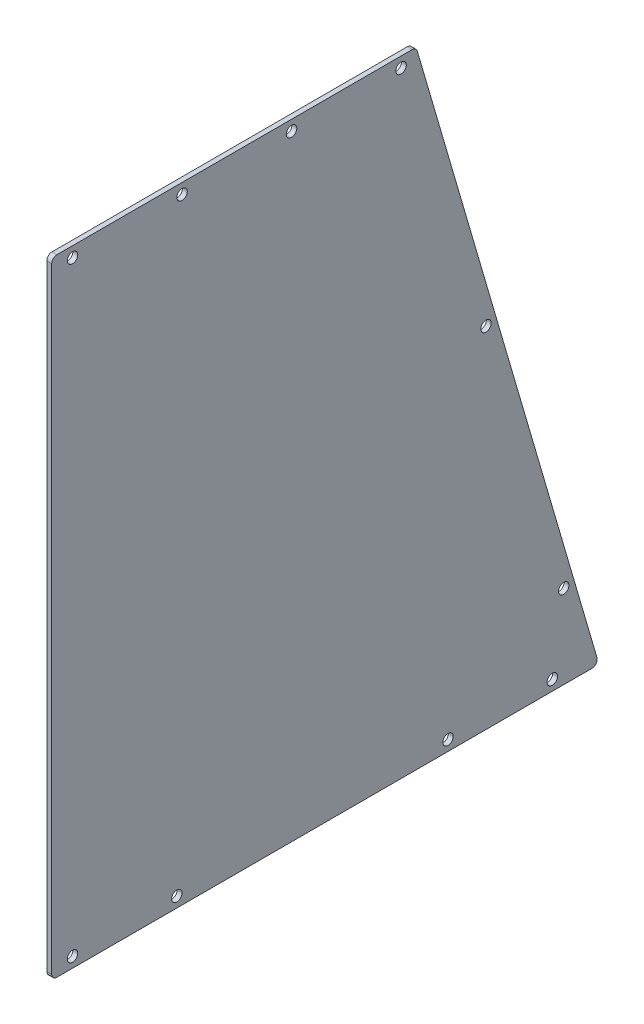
ISO-10303-21;
HEADER;
FILE_DESCRIPTION(('STEP AP214'),'2;1');
FILE_NAME('part.step','',(''),(''),'','','');
FILE_SCHEMA(('AUTOMOTIVE_DESIGN { 1 0 10303 214 1 1 1 1 }'));
ENDSEC;
DATA;
#1=APPLICATION_CONTEXT('core data for automotive mechanical design processes');
#2=APPLICATION_PROTOCOL_DEFINITION('international standard','automotive_design',2000,#1);
#3=PRODUCT_CONTEXT('',#1,'mechanical');
#4=PRODUCT('Part','Part','',(#3));
#5=PRODUCT_RELATED_PRODUCT_CATEGORY('part','',(#4));
#6=PRODUCT_DEFINITION_FORMATION('','',#4);
#7=PRODUCT_DEFINITION_CONTEXT('part definition',#1,'design');
#8=PRODUCT_DEFINITION('design','',#6,#7);
#9=PRODUCT_DEFINITION_SHAPE('','',#8);
#10=(LENGTH_UNIT() NAMED_UNIT(*) SI_UNIT(.MILLI.,.METRE.));
#11=(NAMED_UNIT(*) PLANE_ANGLE_UNIT() SI_UNIT($,.RADIAN.));
#12=(NAMED_UNIT(*) SI_UNIT($,.STERADIAN.) SOLID_ANGLE_UNIT());
#13=UNCERTAINTY_MEASURE_WITH_UNIT(LENGTH_MEASURE(1.E-05),#10,'distance_accuracy_value','');
#14=(GEOMETRIC_REPRESENTATION_CONTEXT(3) GLOBAL_UNCERTAINTY_ASSIGNED_CONTEXT((#13)) GLOBAL_UNIT_ASSIGNED_CONTEXT((#10,
#11,#12)) REPRESENTATION_CONTEXT('',''));
#15=CARTESIAN_POINT('',(0.,0.,0.));
#16=DIRECTION('',(0.,0.,1.));
#17=DIRECTION('',(1.,0.,0.));
#18=AXIS2_PLACEMENT_3D('',#15,#16,#17);
#19=CARTESIAN_POINT('',(226.8347,-67.6339615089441,488.450730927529));
#20=DIRECTION('',(-1.,0.,0.));
#21=DIRECTION('',(0.,0.,1.));
#22=AXIS2_PLACEMENT_3D('',#19,#20,#21);
#23=CYLINDRICAL_SURFACE('',#22,3.175);
#24=CARTESIAN_POINT('',(226.8347,-67.6339615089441,488.450730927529));
#25=DIRECTION('',(1.,0.,0.));
#26=DIRECTION('',(0.,0.,-1.));
#27=AXIS2_PLACEMENT_3D('',#24,#25,#26);
#28=CIRCLE('',#27,3.175);
#29=CARTESIAN_POINT('',(226.8347,-67.6339615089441,491.625730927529));
#30=VERTEX_POINT('',#29);
#31=CARTESIAN_POINT('',(226.8347,-70.8089615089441,488.450730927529));
#32=VERTEX_POINT('',#31);
#33=EDGE_CURVE('E266',#30,#32,#28,.T.);
#34=ORIENTED_EDGE('',*,*,#33,.F.);
#35=DIRECTION('',(1.,0.,0.));
#36=VECTOR('',#35,1.);
#37=CARTESIAN_POINT('',(226.8347,-67.6339615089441,491.625730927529));
#38=LINE('',#37,#36);
#39=CARTESIAN_POINT('',(223.8375,-67.6339615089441,491.625730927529));
#40=VERTEX_POINT('',#39);
#41=EDGE_CURVE('E226',#40,#30,#38,.T.);
#42=ORIENTED_EDGE('',*,*,#41,.F.);
#43=CARTESIAN_POINT('',(223.8375,-67.6339615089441,488.450730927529));
#44=DIRECTION('',(-1.,0.,0.));
#45=DIRECTION('',(0.,0.,-1.));
#46=AXIS2_PLACEMENT_3D('',#43,#44,#45);
#47=CIRCLE('',#46,3.175);
#48=CARTESIAN_POINT('',(223.8375,-70.8089615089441,488.450730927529));
#49=VERTEX_POINT('',#48);
#50=EDGE_CURVE('E11',#49,#40,#47,.T.);
#51=ORIENTED_EDGE('',*,*,#50,.F.);
#52=DIRECTION('',(-1.,0.,0.));
#53=VECTOR('',#52,1.);
#54=CARTESIAN_POINT('',(226.8347,-70.8089615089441,488.450730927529));
#55=LINE('',#54,#53);
#56=EDGE_CURVE('E247',#32,#49,#55,.T.);
#57=ORIENTED_EDGE('',*,*,#56,.F.);
#58=EDGE_LOOP('',(#34,#42,#51,#57));
#59=FACE_BOUND('',#58,.T.);
#60=ADVANCED_FACE('F17',(#59),#23,.T.);
#61=CARTESIAN_POINT('',(226.8347,-67.633961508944,162.648427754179));
#62=DIRECTION('',(-1.,0.,0.));
#63=DIRECTION('',(0.,0.,1.));
#64=AXIS2_PLACEMENT_3D('',#61,#62,#63);
#65=CYLINDRICAL_SURFACE('',#64,3.175);
#66=CARTESIAN_POINT('',(226.8347,-67.633961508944,162.648427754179));
#67=DIRECTION('',(1.,0.,0.));
#68=DIRECTION('',(0.,0.,-1.));
#69=AXIS2_PLACEMENT_3D('',#66,#67,#68);
#70=CIRCLE('',#69,3.175);
#71=CARTESIAN_POINT('',(226.8347,-70.808961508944,162.648427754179));
#72=VERTEX_POINT('',#71);
#73=CARTESIAN_POINT('',(226.8347,-66.7435693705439,159.600834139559));
#74=VERTEX_POINT('',#73);
#75=EDGE_CURVE('E262',#72,#74,#70,.T.);
#76=ORIENTED_EDGE('',*,*,#75,.F.);
#77=DIRECTION('',(1.,0.,0.));
#78=VECTOR('',#77,1.);
#79=CARTESIAN_POINT('',(226.8347,-70.808961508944,162.648427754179));
#80=LINE('',#79,#78);
#81=CARTESIAN_POINT('',(223.8375,-70.808961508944,162.648427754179));
#82=VERTEX_POINT('',#81);
#83=EDGE_CURVE('E238',#82,#72,#80,.T.);
#84=ORIENTED_EDGE('',*,*,#83,.F.);
#85=CARTESIAN_POINT('',(223.8375,-67.633961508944,162.648427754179));
#86=DIRECTION('',(-1.,0.,0.));
#87=DIRECTION('',(0.,0.,-1.));
#88=AXIS2_PLACEMENT_3D('',#85,#86,#87);
#89=CIRCLE('',#88,3.175);
#90=CARTESIAN_POINT('',(223.8375,-66.7435693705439,159.600834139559));
#91=VERTEX_POINT('',#90);
#92=EDGE_CURVE('E20',#91,#82,#89,.T.);
#93=ORIENTED_EDGE('',*,*,#92,.F.);
#94=DIRECTION('',(-1.,0.,0.));
#95=VECTOR('',#94,1.);
#96=CARTESIAN_POINT('',(226.8347,-66.7435693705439,159.600834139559));
#97=LINE('',#96,#95);
#98=EDGE_CURVE('E212',#74,#91,#97,.T.);
#99=ORIENTED_EDGE('',*,*,#98,.F.);
#100=EDGE_LOOP('',(#76,#84,#93,#99));
#101=FACE_BOUND('',#100,.T.);
#102=ADVANCED_FACE('F359',(#101),#65,.T.);
#103=CARTESIAN_POINT('',(226.8347,307.016038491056,272.107055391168));
#104=DIRECTION('',(-1.,0.,0.));
#105=DIRECTION('',(0.,0.,1.));
#106=AXIS2_PLACEMENT_3D('',#103,#104,#105);
#107=CYLINDRICAL_SURFACE('',#106,3.175);
#108=CARTESIAN_POINT('',(226.8347,307.016038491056,272.107055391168));
#109=DIRECTION('',(1.,0.,0.));
#110=DIRECTION('',(0.,0.,-1.));
#111=AXIS2_PLACEMENT_3D('',#108,#109,#110);
#112=CIRCLE('',#111,3.175);
#113=CARTESIAN_POINT('',(226.8347,307.906430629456,269.059461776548));
#114=VERTEX_POINT('',#113);
#115=CARTESIAN_POINT('',(226.8347,310.191038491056,272.107055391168));
#116=VERTEX_POINT('',#115);
#117=EDGE_CURVE('E265',#114,#116,#112,.T.);
#118=ORIENTED_EDGE('',*,*,#117,.F.);
#119=DIRECTION('',(1.,0.,0.));
#120=VECTOR('',#119,1.);
#121=CARTESIAN_POINT('',(226.8347,307.906430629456,269.059461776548));
#122=LINE('',#121,#120);
#123=CARTESIAN_POINT('',(223.8375,307.906430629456,269.059461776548));
#124=VERTEX_POINT('',#123);
#125=EDGE_CURVE('E188',#124,#114,#122,.T.);
#126=ORIENTED_EDGE('',*,*,#125,.F.);
#127=CARTESIAN_POINT('',(223.8375,307.016038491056,272.107055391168));
#128=DIRECTION('',(-1.,0.,0.));
#129=DIRECTION('',(0.,0.,-1.));
#130=AXIS2_PLACEMENT_3D('',#127,#128,#129);
#131=CIRCLE('',#130,3.175);
#132=CARTESIAN_POINT('',(223.8375,310.191038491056,272.107055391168));
#133=VERTEX_POINT('',#132);
#134=EDGE_CURVE('E182',#133,#124,#131,.T.);
#135=ORIENTED_EDGE('',*,*,#134,.F.);
#136=DIRECTION('',(-1.,0.,0.));
#137=VECTOR('',#136,1.);
#138=CARTESIAN_POINT('',(226.8347,310.191038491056,272.107055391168));
#139=LINE('',#138,#137);
#140=EDGE_CURVE('E185',#116,#133,#139,.T.);
#141=ORIENTED_EDGE('',*,*,#140,.F.);
#142=EDGE_LOOP('',(#118,#126,#135,#141));
#143=FACE_BOUND('',#142,.T.);
#144=ADVANCED_FACE('F184',(#143),#107,.T.);
#145=CARTESIAN_POINT('',(226.8347,307.016038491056,488.450730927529));
#146=DIRECTION('',(-1.,0.,0.));
#147=DIRECTION('',(0.,0.,1.));
#148=AXIS2_PLACEMENT_3D('',#145,#146,#147);
#149=CYLINDRICAL_SURFACE('',#148,3.175);
#150=CARTESIAN_POINT('',(226.8347,307.016038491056,488.450730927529));
#151=DIRECTION('',(1.,0.,0.));
#152=DIRECTION('',(0.,0.,-1.));
#153=AXIS2_PLACEMENT_3D('',#150,#151,#152);
#154=CIRCLE('',#153,3.175);
#155=CARTESIAN_POINT('',(226.8347,310.191038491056,488.450730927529));
#156=VERTEX_POINT('',#155);
#157=CARTESIAN_POINT('',(226.8347,307.016038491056,491.625730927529));
#158=VERTEX_POINT('',#157);
#159=EDGE_CURVE('E283',#156,#158,#154,.T.);
#160=ORIENTED_EDGE('',*,*,#159,.F.);
#161=DIRECTION('',(1.,0.,0.));
#162=VECTOR('',#161,1.);
#163=CARTESIAN_POINT('',(226.8347,310.191038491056,488.450730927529));
#164=LINE('',#163,#162);
#165=CARTESIAN_POINT('',(223.8375,310.191038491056,488.450730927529));
#166=VERTEX_POINT('',#165);
#167=EDGE_CURVE('E211',#166,#156,#164,.T.);
#168=ORIENTED_EDGE('',*,*,#167,.F.);
#169=CARTESIAN_POINT('',(223.8375,307.016038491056,488.450730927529));
#170=DIRECTION('',(-1.,0.,0.));
#171=DIRECTION('',(0.,0.,-1.));
#172=AXIS2_PLACEMENT_3D('',#169,#170,#171);
#173=CIRCLE('',#172,3.175);
#174=CARTESIAN_POINT('',(223.8375,307.016038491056,491.625730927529));
#175=VERTEX_POINT('',#174);
#176=EDGE_CURVE('E194',#175,#166,#173,.T.);
#177=ORIENTED_EDGE('',*,*,#176,.F.);
#178=DIRECTION('',(-1.,0.,0.));
#179=VECTOR('',#178,1.);
#180=CARTESIAN_POINT('',(226.8347,307.016038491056,491.625730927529));
#181=LINE('',#180,#179);
#182=EDGE_CURVE('E231',#158,#175,#181,.T.);
#183=ORIENTED_EDGE('',*,*,#182,.F.);
#184=EDGE_LOOP('',(#160,#168,#177,#183));
#185=FACE_BOUND('',#184,.T.);
#186=ADVANCED_FACE('F361',(#185),#149,.T.);
#187=CARTESIAN_POINT('',(228.6,141.916038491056,227.178782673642));
#188=DIRECTION('',(-1.,0.,0.));
#189=DIRECTION('',(0.,0.,1.));
#190=AXIS2_PLACEMENT_3D('',#187,#188,#189);
#191=CYLINDRICAL_SURFACE('',#190,3.175);
#192=CARTESIAN_POINT('',(223.8375,141.916038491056,227.178782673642));
#193=DIRECTION('',(-1.,0.,0.));
#194=DIRECTION('',(0.,0.,-1.));
#195=AXIS2_PLACEMENT_3D('',#192,#193,#194);
#196=CIRCLE('',#195,3.175);
#197=CARTESIAN_POINT('',(223.8375,141.916038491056,224.003782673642));
#198=VERTEX_POINT('',#197);
#199=EDGE_CURVE('E293',#198,#198,#196,.T.);
#200=ORIENTED_EDGE('',*,*,#199,.T.);
#201=EDGE_LOOP('',(#200));
#202=FACE_BOUND('',#201,.T.);
#203=CARTESIAN_POINT('',(226.8347,141.916038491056,227.178782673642));
#204=DIRECTION('',(-1.,0.,0.));
#205=DIRECTION('',(0.,0.,-1.));
#206=AXIS2_PLACEMENT_3D('',#203,#204,#205);
#207=CIRCLE('',#206,3.175);
#208=CARTESIAN_POINT('',(226.8347,141.916038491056,224.003782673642));
#209=VERTEX_POINT('',#208);
#210=EDGE_CURVE('E243',#209,#209,#207,.T.);
#211=ORIENTED_EDGE('',*,*,#210,.F.);
#212=EDGE_LOOP('',(#211));
#213=FACE_BOUND('',#212,.T.);
#214=ADVANCED_FACE('F363',(#202,#213),#191,.F.);
#215=CARTESIAN_POINT('',(228.6,-20.0089615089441,179.87039276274));
#216=DIRECTION('',(-1.,0.,0.));
#217=DIRECTION('',(0.,0.,1.));
#218=AXIS2_PLACEMENT_3D('',#215,#216,#217);
#219=CYLINDRICAL_SURFACE('',#218,3.175);
#220=CARTESIAN_POINT('',(223.8375,-20.0089615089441,179.87039276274));
#221=DIRECTION('',(-1.,0.,0.));
#222=DIRECTION('',(0.,0.,-1.));
#223=AXIS2_PLACEMENT_3D('',#220,#221,#222);
#224=CIRCLE('',#223,3.175);
#225=CARTESIAN_POINT('',(223.8375,-20.0089615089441,176.69539276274));
#226=VERTEX_POINT('',#225);
#227=EDGE_CURVE('E261',#226,#226,#224,.T.);
#228=ORIENTED_EDGE('',*,*,#227,.T.);
#229=EDGE_LOOP('',(#228));
#230=FACE_BOUND('',#229,.T.);
#231=CARTESIAN_POINT('',(226.8347,-20.0089615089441,179.87039276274));
#232=DIRECTION('',(-1.,0.,0.));
#233=DIRECTION('',(0.,0.,-1.));
#234=AXIS2_PLACEMENT_3D('',#231,#232,#233);
#235=CIRCLE('',#234,3.175);
#236=CARTESIAN_POINT('',(226.8347,-20.0089615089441,176.69539276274));
#237=VERTEX_POINT('',#236);
#238=EDGE_CURVE('E246',#237,#237,#235,.T.);
#239=ORIENTED_EDGE('',*,*,#238,.F.);
#240=EDGE_LOOP('',(#239));
#241=FACE_BOUND('',#240,.T.);
#242=ADVANCED_FACE('F371',(#230,#241),#219,.F.);
#243=CARTESIAN_POINT('',(228.6,-64.4589615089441,478.925730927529));
#244=DIRECTION('',(-1.,0.,0.));
#245=DIRECTION('',(0.,0.,1.));
#246=AXIS2_PLACEMENT_3D('',#243,#244,#245);
#247=CYLINDRICAL_SURFACE('',#246,3.175);
#248=CARTESIAN_POINT('',(223.8375,-64.4589615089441,478.925730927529));
#249=DIRECTION('',(-1.,0.,0.));
#250=DIRECTION('',(0.,0.,-1.));
#251=AXIS2_PLACEMENT_3D('',#248,#249,#250);
#252=CIRCLE('',#251,3.175);
#253=CARTESIAN_POINT('',(223.8375,-64.4589615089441,475.750730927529));
#254=VERTEX_POINT('',#253);
#255=EDGE_CURVE('E257',#254,#254,#252,.T.);
#256=ORIENTED_EDGE('',*,*,#255,.T.);
#257=EDGE_LOOP('',(#256));
#258=FACE_BOUND('',#257,.T.);
#259=CARTESIAN_POINT('',(226.8347,-64.4589615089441,478.925730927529));
#260=DIRECTION('',(-1.,0.,0.));
#261=DIRECTION('',(0.,0.,-1.));
#262=AXIS2_PLACEMENT_3D('',#259,#260,#261);
#263=CIRCLE('',#262,3.175);
#264=CARTESIAN_POINT('',(226.8347,-64.4589615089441,475.750730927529));
#265=VERTEX_POINT('',#264);
#266=EDGE_CURVE('E250',#265,#265,#263,.T.);
#267=ORIENTED_EDGE('',*,*,#266,.F.);
#268=EDGE_LOOP('',(#267));
#269=FACE_BOUND('',#268,.T.);
#270=ADVANCED_FACE('F416',(#258,#269),#247,.F.);
#271=CARTESIAN_POINT('',(228.6,-64.4589615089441,415.425730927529));
#272=DIRECTION('',(-1.,0.,0.));
#273=DIRECTION('',(0.,0.,1.));
#274=AXIS2_PLACEMENT_3D('',#271,#272,#273);
#275=CYLINDRICAL_SURFACE('',#274,3.175);
#276=CARTESIAN_POINT('',(223.8375,-64.4589615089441,415.425730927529));
#277=DIRECTION('',(-1.,0.,0.));
#278=DIRECTION('',(0.,0.,-1.));
#279=AXIS2_PLACEMENT_3D('',#276,#277,#278);
#280=CIRCLE('',#279,3.175);
#281=CARTESIAN_POINT('',(223.8375,-64.4589615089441,412.250730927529));
#282=VERTEX_POINT('',#281);
#283=EDGE_CURVE('E260',#282,#282,#280,.T.);
#284=ORIENTED_EDGE('',*,*,#283,.T.);
#285=EDGE_LOOP('',(#284));
#286=FACE_BOUND('',#285,.T.);
#287=CARTESIAN_POINT('',(226.8347,-64.4589615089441,415.425730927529));
#288=DIRECTION('',(-1.,0.,0.));
#289=DIRECTION('',(0.,0.,-1.));
#290=AXIS2_PLACEMENT_3D('',#287,#288,#289);
#291=CIRCLE('',#290,3.175);
#292=CARTESIAN_POINT('',(226.8347,-64.4589615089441,412.250730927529));
#293=VERTEX_POINT('',#292);
#294=EDGE_CURVE('E253',#293,#293,#291,.T.);
#295=ORIENTED_EDGE('',*,*,#294,.F.);
#296=EDGE_LOOP('',(#295));
#297=FACE_BOUND('',#296,.T.);
#298=ADVANCED_FACE('F425',(#286,#297),#275,.F.);
#299=CARTESIAN_POINT('',(228.6,-64.4589615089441,250.325730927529));
#300=DIRECTION('',(-1.,0.,0.));
#301=DIRECTION('',(0.,0.,1.));
#302=AXIS2_PLACEMENT_3D('',#299,#300,#301);
#303=CYLINDRICAL_SURFACE('',#302,3.175);
#304=CARTESIAN_POINT('',(223.8375,-64.4589615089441,250.325730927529));
#305=DIRECTION('',(-1.,0.,0.));
#306=DIRECTION('',(0.,0.,-1.));
#307=AXIS2_PLACEMENT_3D('',#304,#305,#306);
#308=CIRCLE('',#307,3.175);
#309=CARTESIAN_POINT('',(223.8375,-64.4589615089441,247.150730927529));
#310=VERTEX_POINT('',#309);
#311=EDGE_CURVE('E296',#310,#310,#308,.T.);
#312=ORIENTED_EDGE('',*,*,#311,.T.);
#313=EDGE_LOOP('',(#312));
#314=FACE_BOUND('',#313,.T.);
#315=CARTESIAN_POINT('',(226.8347,-64.4589615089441,250.325730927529));
#316=DIRECTION('',(-1.,0.,0.));
#317=DIRECTION('',(0.,0.,-1.));
#318=AXIS2_PLACEMENT_3D('',#315,#316,#317);
#319=CIRCLE('',#318,3.175);
#320=CARTESIAN_POINT('',(226.8347,-64.4589615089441,247.150730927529));
#321=VERTEX_POINT('',#320);
#322=EDGE_CURVE('E256',#321,#321,#319,.T.);
#323=ORIENTED_EDGE('',*,*,#322,.F.);
#324=EDGE_LOOP('',(#323));
#325=FACE_BOUND('',#324,.T.);
#326=ADVANCED_FACE('F433',(#314,#325),#303,.F.);
#327=CARTESIAN_POINT('',(228.6,-64.458961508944,186.825730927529));
#328=DIRECTION('',(-1.,0.,0.));
#329=DIRECTION('',(0.,0.,1.));
#330=AXIS2_PLACEMENT_3D('',#327,#328,#329);
#331=CYLINDRICAL_SURFACE('',#330,3.175);
#332=CARTESIAN_POINT('',(223.8375,-64.458961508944,186.825730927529));
#333=DIRECTION('',(-1.,0.,0.));
#334=DIRECTION('',(0.,0.,-1.));
#335=AXIS2_PLACEMENT_3D('',#332,#333,#334);
#336=CIRCLE('',#335,3.175);
#337=CARTESIAN_POINT('',(223.8375,-64.458961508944,183.650730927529));
#338=VERTEX_POINT('',#337);
#339=EDGE_CURVE('E299',#338,#338,#336,.T.);
#340=ORIENTED_EDGE('',*,*,#339,.T.);
#341=EDGE_LOOP('',(#340));
#342=FACE_BOUND('',#341,.T.);
#343=CARTESIAN_POINT('',(226.8347,-64.458961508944,186.825730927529));
#344=DIRECTION('',(-1.,0.,0.));
#345=DIRECTION('',(0.,0.,-1.));
#346=AXIS2_PLACEMENT_3D('',#343,#344,#345);
#347=CIRCLE('',#346,3.175);
#348=CARTESIAN_POINT('',(226.8347,-64.458961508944,183.650730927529));
#349=VERTEX_POINT('',#348);
#350=EDGE_CURVE('E268',#349,#349,#347,.T.);
#351=ORIENTED_EDGE('',*,*,#350,.F.);
#352=EDGE_LOOP('',(#351));
#353=FACE_BOUND('',#352,.T.);
#354=ADVANCED_FACE('F442',(#342,#353),#331,.F.);
#355=CARTESIAN_POINT('',(228.6,303.841038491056,278.900730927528));
#356=DIRECTION('',(-1.,0.,0.));
#357=DIRECTION('',(0.,0.,1.));
#358=AXIS2_PLACEMENT_3D('',#355,#356,#357);
#359=CYLINDRICAL_SURFACE('',#358,3.175);
#360=CARTESIAN_POINT('',(223.8375,303.841038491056,278.900730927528));
#361=DIRECTION('',(-1.,0.,0.));
#362=DIRECTION('',(0.,0.,-1.));
#363=AXIS2_PLACEMENT_3D('',#360,#361,#362);
#364=CIRCLE('',#363,3.175);
#365=CARTESIAN_POINT('',(223.8375,303.841038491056,275.725730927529));
#366=VERTEX_POINT('',#365);
#367=EDGE_CURVE('E277',#366,#366,#364,.T.);
#368=ORIENTED_EDGE('',*,*,#367,.T.);
#369=EDGE_LOOP('',(#368));
#370=FACE_BOUND('',#369,.T.);
#371=CARTESIAN_POINT('',(226.8347,303.841038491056,278.900730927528));
#372=DIRECTION('',(-1.,0.,0.));
#373=DIRECTION('',(0.,0.,-1.));
#374=AXIS2_PLACEMENT_3D('',#371,#372,#373);
#375=CIRCLE('',#374,3.175);
#376=CARTESIAN_POINT('',(226.8347,303.841038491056,275.725730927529));
#377=VERTEX_POINT('',#376);
#378=EDGE_CURVE('E270',#377,#377,#375,.T.);
#379=ORIENTED_EDGE('',*,*,#378,.F.);
#380=EDGE_LOOP('',(#379));
#381=FACE_BOUND('',#380,.T.);
#382=ADVANCED_FACE('F451',(#370,#381),#359,.F.);
#383=CARTESIAN_POINT('',(228.6,303.841038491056,345.575730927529));
#384=DIRECTION('',(-1.,0.,0.));
#385=DIRECTION('',(0.,0.,1.));
#386=AXIS2_PLACEMENT_3D('',#383,#384,#385);
#387=CYLINDRICAL_SURFACE('',#386,3.175);
#388=CARTESIAN_POINT('',(223.8375,303.841038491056,345.575730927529));
#389=DIRECTION('',(-1.,0.,0.));
#390=DIRECTION('',(0.,0.,-1.));
#391=AXIS2_PLACEMENT_3D('',#388,#389,#390);
#392=CIRCLE('',#391,3.175);
#393=CARTESIAN_POINT('',(223.8375,303.841038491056,342.400730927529));
#394=VERTEX_POINT('',#393);
#395=EDGE_CURVE('E274',#394,#394,#392,.T.);
#396=ORIENTED_EDGE('',*,*,#395,.T.);
#397=EDGE_LOOP('',(#396));
#398=FACE_BOUND('',#397,.T.);
#399=CARTESIAN_POINT('',(226.8347,303.841038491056,345.575730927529));
#400=DIRECTION('',(-1.,0.,0.));
#401=DIRECTION('',(0.,0.,-1.));
#402=AXIS2_PLACEMENT_3D('',#399,#400,#401);
#403=CIRCLE('',#402,3.175);
#404=CARTESIAN_POINT('',(226.8347,303.841038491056,342.400730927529));
#405=VERTEX_POINT('',#404);
#406=EDGE_CURVE('E273',#405,#405,#403,.T.);
#407=ORIENTED_EDGE('',*,*,#406,.F.);
#408=EDGE_LOOP('',(#407));
#409=FACE_BOUND('',#408,.T.);
#410=ADVANCED_FACE('F460',(#398,#409),#387,.F.);
#411=CARTESIAN_POINT('',(228.6,303.841038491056,478.925730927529));
#412=DIRECTION('',(-1.,0.,0.));
#413=DIRECTION('',(0.,0.,1.));
#414=AXIS2_PLACEMENT_3D('',#411,#412,#413);
#415=CYLINDRICAL_SURFACE('',#414,3.175);
#416=CARTESIAN_POINT('',(223.8375,303.841038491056,478.925730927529));
#417=DIRECTION('',(-1.,0.,0.));
#418=DIRECTION('',(0.,0.,-1.));
#419=AXIS2_PLACEMENT_3D('',#416,#417,#418);
#420=CIRCLE('',#419,3.175);
#421=CARTESIAN_POINT('',(223.8375,303.841038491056,475.750730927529));
#422=VERTEX_POINT('',#421);
#423=EDGE_CURVE('E43',#422,#422,#420,.T.);
#424=ORIENTED_EDGE('',*,*,#423,.T.);
#425=EDGE_LOOP('',(#424));
#426=FACE_BOUND('',#425,.T.);
#427=CARTESIAN_POINT('',(226.8347,303.841038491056,478.925730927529));
#428=DIRECTION('',(-1.,0.,0.));
#429=DIRECTION('',(0.,0.,-1.));
#430=AXIS2_PLACEMENT_3D('',#427,#428,#429);
#431=CIRCLE('',#430,3.175);
#432=CARTESIAN_POINT('',(226.8347,303.841038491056,475.750730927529));
#433=VERTEX_POINT('',#432);
#434=EDGE_CURVE('E280',#433,#433,#431,.T.);
#435=ORIENTED_EDGE('',*,*,#434,.F.);
#436=EDGE_LOOP('',(#435));
#437=FACE_BOUND('',#436,.T.);
#438=ADVANCED_FACE('F469',(#426,#437),#415,.F.);
#439=CARTESIAN_POINT('',(228.6,303.841038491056,412.250730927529));
#440=DIRECTION('',(-1.,0.,0.));
#441=DIRECTION('',(0.,0.,1.));
#442=AXIS2_PLACEMENT_3D('',#439,#440,#441);
#443=CYLINDRICAL_SURFACE('',#442,3.175);
#444=CARTESIAN_POINT('',(223.8375,303.841038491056,412.250730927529));
#445=DIRECTION('',(-1.,0.,0.));
#446=DIRECTION('',(0.,0.,-1.));
#447=AXIS2_PLACEMENT_3D('',#444,#445,#446);
#448=CIRCLE('',#447,3.175);
#449=CARTESIAN_POINT('',(223.8375,303.841038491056,409.075730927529));
#450=VERTEX_POINT('',#449);
#451=EDGE_CURVE('E36',#450,#450,#448,.T.);
#452=ORIENTED_EDGE('',*,*,#451,.T.);
#453=EDGE_LOOP('',(#452));
#454=FACE_BOUND('',#453,.T.);
#455=CARTESIAN_POINT('',(226.8347,303.841038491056,412.250730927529));
#456=DIRECTION('',(-1.,0.,0.));
#457=DIRECTION('',(0.,0.,-1.));
#458=AXIS2_PLACEMENT_3D('',#455,#456,#457);
#459=CIRCLE('',#458,3.175);
#460=CARTESIAN_POINT('',(226.8347,303.841038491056,409.075730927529));
#461=VERTEX_POINT('',#460);
#462=EDGE_CURVE('E286',#461,#461,#459,.T.);
#463=ORIENTED_EDGE('',*,*,#462,.F.);
#464=EDGE_LOOP('',(#463));
#465=FACE_BOUND('',#464,.T.);
#466=ADVANCED_FACE('F478',(#454,#465),#443,.F.);
#467=CARTESIAN_POINT('',(223.8375,92.4471193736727,315.621293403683));
#468=DIRECTION('',(1.,0.,0.));
#469=DIRECTION('',(0.,1.,0.));
#470=AXIS2_PLACEMENT_3D('',#467,#468,#469);
#471=PLANE('',#470);
#472=DIRECTION('',(0.,-1.,0.));
#473=VECTOR('',#472,1.);
#474=CARTESIAN_POINT('',(223.8375,119.691038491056,491.625730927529));
#475=LINE('',#474,#473);
#476=EDGE_CURVE('E230',#175,#40,#475,.T.);
#477=ORIENTED_EDGE('',*,*,#476,.F.);
#478=ORIENTED_EDGE('',*,*,#176,.T.);
#479=DIRECTION('',(0.,0.,1.));
#480=VECTOR('',#479,1.);
#481=CARTESIAN_POINT('',(223.8375,310.191038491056,380.676334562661));
#482=LINE('',#481,#480);
#483=EDGE_CURVE('E200',#133,#166,#482,.T.);
#484=ORIENTED_EDGE('',*,*,#483,.F.);
#485=ORIENTED_EDGE('',*,*,#134,.T.);
#486=DIRECTION('',(0.,0.959872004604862,0.280438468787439));
#487=VECTOR('',#486,1.);
#488=CARTESIAN_POINT('',(223.8375,117.098937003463,213.312694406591));
#489=LINE('',#488,#487);
#490=EDGE_CURVE('E349',#91,#124,#489,.T.);
#491=ORIENTED_EDGE('',*,*,#490,.F.);
#492=ORIENTED_EDGE('',*,*,#92,.T.);
#493=DIRECTION('',(0.,0.,-1.));
#494=VECTOR('',#493,1.);
#495=CARTESIAN_POINT('',(223.8375,-70.8089615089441,325.019405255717));
#496=LINE('',#495,#494);
#497=EDGE_CURVE('E229',#49,#82,#496,.T.);
#498=ORIENTED_EDGE('',*,*,#497,.F.);
#499=ORIENTED_EDGE('',*,*,#50,.T.);
#500=EDGE_LOOP('',(#477,#478,#484,#485,#491,#492,#498,#499));
#501=FACE_BOUND('',#500,.T.);
#502=ORIENTED_EDGE('',*,*,#451,.F.);
#503=EDGE_LOOP('',(#502));
#504=FACE_BOUND('',#503,.T.);
#505=ORIENTED_EDGE('',*,*,#423,.F.);
#506=EDGE_LOOP('',(#505));
#507=FACE_BOUND('',#506,.T.);
#508=ORIENTED_EDGE('',*,*,#395,.F.);
#509=EDGE_LOOP('',(#508));
#510=FACE_BOUND('',#509,.T.);
#511=ORIENTED_EDGE('',*,*,#367,.F.);
#512=EDGE_LOOP('',(#511));
#513=FACE_BOUND('',#512,.T.);
#514=ORIENTED_EDGE('',*,*,#339,.F.);
#515=EDGE_LOOP('',(#514));
#516=FACE_BOUND('',#515,.T.);
#517=ORIENTED_EDGE('',*,*,#311,.F.);
#518=EDGE_LOOP('',(#517));
#519=FACE_BOUND('',#518,.T.);
#520=ORIENTED_EDGE('',*,*,#283,.F.);
#521=EDGE_LOOP('',(#520));
#522=FACE_BOUND('',#521,.T.);
#523=ORIENTED_EDGE('',*,*,#255,.F.);
#524=EDGE_LOOP('',(#523));
#525=FACE_BOUND('',#524,.T.);
#526=ORIENTED_EDGE('',*,*,#227,.F.);
#527=EDGE_LOOP('',(#526));
#528=FACE_BOUND('',#527,.T.);
#529=ORIENTED_EDGE('',*,*,#199,.F.);
#530=EDGE_LOOP('',(#529));
#531=FACE_BOUND('',#530,.T.);
#532=ADVANCED_FACE('F207',(#501,#504,#507,#510,#513,#516,#519,#522,#525,#528,#531),#471,.F.);
#533=CARTESIAN_POINT('',(226.8347,92.4471193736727,315.621293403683));
#534=DIRECTION('',(1.,0.,0.));
#535=DIRECTION('',(0.,1.,0.));
#536=AXIS2_PLACEMENT_3D('',#533,#534,#535);
#537=PLANE('',#536);
#538=DIRECTION('',(0.,0.,1.));
#539=VECTOR('',#538,1.);
#540=CARTESIAN_POINT('',(226.8347,310.191038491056,380.676334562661));
#541=LINE('',#540,#539);
#542=EDGE_CURVE('E202',#116,#156,#541,.T.);
#543=ORIENTED_EDGE('',*,*,#542,.T.);
#544=ORIENTED_EDGE('',*,*,#159,.T.);
#545=DIRECTION('',(0.,-1.,0.));
#546=VECTOR('',#545,1.);
#547=CARTESIAN_POINT('',(226.8347,119.691038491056,491.625730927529));
#548=LINE('',#547,#546);
#549=EDGE_CURVE('E204',#158,#30,#548,.T.);
#550=ORIENTED_EDGE('',*,*,#549,.T.);
#551=ORIENTED_EDGE('',*,*,#33,.T.);
#552=DIRECTION('',(0.,0.,-1.));
#553=VECTOR('',#552,1.);
#554=CARTESIAN_POINT('',(226.8347,-70.8089615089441,325.019405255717));
#555=LINE('',#554,#553);
#556=EDGE_CURVE('E242',#32,#72,#555,.T.);
#557=ORIENTED_EDGE('',*,*,#556,.T.);
#558=ORIENTED_EDGE('',*,*,#75,.T.);
#559=DIRECTION('',(0.,0.959872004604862,0.280438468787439));
#560=VECTOR('',#559,1.);
#561=CARTESIAN_POINT('',(226.8347,117.098937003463,213.312694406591));
#562=LINE('',#561,#560);
#563=EDGE_CURVE('E221',#74,#114,#562,.T.);
#564=ORIENTED_EDGE('',*,*,#563,.T.);
#565=ORIENTED_EDGE('',*,*,#117,.T.);
#566=EDGE_LOOP('',(#543,#544,#550,#551,#557,#558,#564,#565));
#567=FACE_BOUND('',#566,.T.);
#568=ORIENTED_EDGE('',*,*,#462,.T.);
#569=EDGE_LOOP('',(#568));
#570=FACE_BOUND('',#569,.T.);
#571=ORIENTED_EDGE('',*,*,#434,.T.);
#572=EDGE_LOOP('',(#571));
#573=FACE_BOUND('',#572,.T.);
#574=ORIENTED_EDGE('',*,*,#406,.T.);
#575=EDGE_LOOP('',(#574));
#576=FACE_BOUND('',#575,.T.);
#577=ORIENTED_EDGE('',*,*,#378,.T.);
#578=EDGE_LOOP('',(#577));
#579=FACE_BOUND('',#578,.T.);
#580=ORIENTED_EDGE('',*,*,#350,.T.);
#581=EDGE_LOOP('',(#580));
#582=FACE_BOUND('',#581,.T.);
#583=ORIENTED_EDGE('',*,*,#322,.T.);
#584=EDGE_LOOP('',(#583));
#585=FACE_BOUND('',#584,.T.);
#586=ORIENTED_EDGE('',*,*,#294,.T.);
#587=EDGE_LOOP('',(#586));
#588=FACE_BOUND('',#587,.T.);
#589=ORIENTED_EDGE('',*,*,#266,.T.);
#590=EDGE_LOOP('',(#589));
#591=FACE_BOUND('',#590,.T.);
#592=ORIENTED_EDGE('',*,*,#238,.T.);
#593=EDGE_LOOP('',(#592));
#594=FACE_BOUND('',#593,.T.);
#595=ORIENTED_EDGE('',*,*,#210,.T.);
#596=EDGE_LOOP('',(#595));
#597=FACE_BOUND('',#596,.T.);
#598=ADVANCED_FACE('F317',(#567,#570,#573,#576,#579,#582,#585,#588,#591,#594,#597),#537,.T.);
#599=CARTESIAN_POINT('',(226.8347,-70.8089615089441,325.019405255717));
#600=DIRECTION('',(0.,1.,0.));
#601=DIRECTION('',(0.,0.,-1.));
#602=AXIS2_PLACEMENT_3D('',#599,#600,#601);
#603=PLANE('',#602);
#604=ORIENTED_EDGE('',*,*,#497,.T.);
#605=ORIENTED_EDGE('',*,*,#83,.T.);
#606=ORIENTED_EDGE('',*,*,#556,.F.);
#607=ORIENTED_EDGE('',*,*,#56,.T.);
#608=EDGE_LOOP('',(#604,#605,#606,#607));
#609=FACE_BOUND('',#608,.T.);
#610=ADVANCED_FACE('F333',(#609),#603,.F.);
#611=CARTESIAN_POINT('',(226.8347,119.691038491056,491.625730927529));
#612=DIRECTION('',(0.,0.,-1.));
#613=DIRECTION('',(0.,-1.,0.));
#614=AXIS2_PLACEMENT_3D('',#611,#612,#613);
#615=PLANE('',#614);
#616=ORIENTED_EDGE('',*,*,#549,.F.);
#617=ORIENTED_EDGE('',*,*,#182,.T.);
#618=ORIENTED_EDGE('',*,*,#476,.T.);
#619=ORIENTED_EDGE('',*,*,#41,.T.);
#620=EDGE_LOOP('',(#616,#617,#618,#619));
#621=FACE_BOUND('',#620,.T.);
#622=ADVANCED_FACE('F323',(#621),#615,.F.);
#623=CARTESIAN_POINT('',(226.8347,310.191038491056,380.676334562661));
#624=DIRECTION('',(0.,-1.,0.));
#625=DIRECTION('',(0.,0.,-1.));
#626=AXIS2_PLACEMENT_3D('',#623,#624,#625);
#627=PLANE('',#626);
#628=ORIENTED_EDGE('',*,*,#483,.T.);
#629=ORIENTED_EDGE('',*,*,#167,.T.);
#630=ORIENTED_EDGE('',*,*,#542,.F.);
#631=ORIENTED_EDGE('',*,*,#140,.T.);
#632=EDGE_LOOP('',(#628,#629,#630,#631));
#633=FACE_BOUND('',#632,.T.);
#634=ADVANCED_FACE('F198',(#633),#627,.F.);
#635=CARTESIAN_POINT('',(226.8347,117.098937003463,213.312694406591));
#636=DIRECTION('',(0.,-0.280438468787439,0.959872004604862));
#637=DIRECTION('',(-1.,0.,0.));
#638=AXIS2_PLACEMENT_3D('',#635,#636,#637);
#639=PLANE('',#638);
#640=ORIENTED_EDGE('',*,*,#490,.T.);
#641=ORIENTED_EDGE('',*,*,#125,.T.);
#642=ORIENTED_EDGE('',*,*,#563,.F.);
#643=ORIENTED_EDGE('',*,*,#98,.T.);
#644=EDGE_LOOP('',(#640,#641,#642,#643));
#645=FACE_BOUND('',#644,.T.);
#646=ADVANCED_FACE('F355',(#645),#639,.F.);
#647=CLOSED_SHELL('',(#60,#102,#144,#186,#214,#242,#270,#298,#326,#354,#382,#410,#438,#466,#532,
#598,#610,#622,#634,#646));
#648=MANIFOLD_SOLID_BREP('B1',#647);
#649=ADVANCED_BREP_SHAPE_REPRESENTATION('',(#18,#648),#14);
#650=SHAPE_DEFINITION_REPRESENTATION(#9,#649);
ENDSEC;
END-ISO-10303-21;
